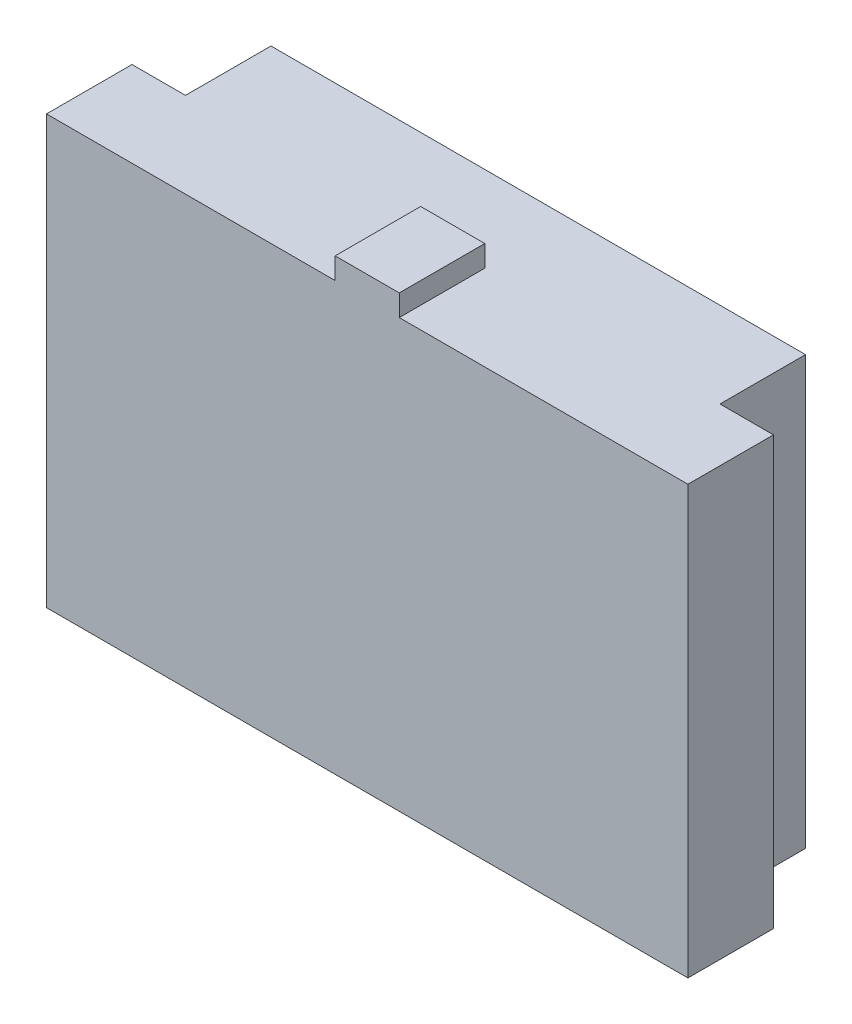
from build123d import *

# Parameters (mm, degrees)
BOSS_EXTRU_1_DEPTH = 8
ESQUISSE3_W        = 50
ESQUISSE3_H        = 40
BOSS_EXTRU_3_DEPTH = 8


with BuildPart() as part:
    # Esquisse1 → Boss.-Extru.1 (new body)
    with BuildSketch(Plane.XY):
        Polygon((0, 40), (0, 0), (60, 0), (60, 40), (33, 40), (33, 42), (27, 42), (27, 40), align=None)
    extrude(amount=BOSS_EXTRU_1_DEPTH)

    # Esquisse3 → Boss.-Extru.3 (add)
    with BuildSketch(Plane(origin=(0, 0, 0), x_dir=(-1, 0, 0), z_dir=(0, 0, -1))):
        with Locations((-30, 20)):
            Rectangle(ESQUISSE3_W, ESQUISSE3_H)
    extrude(amount=BOSS_EXTRU_3_DEPTH)


solid = part.part
